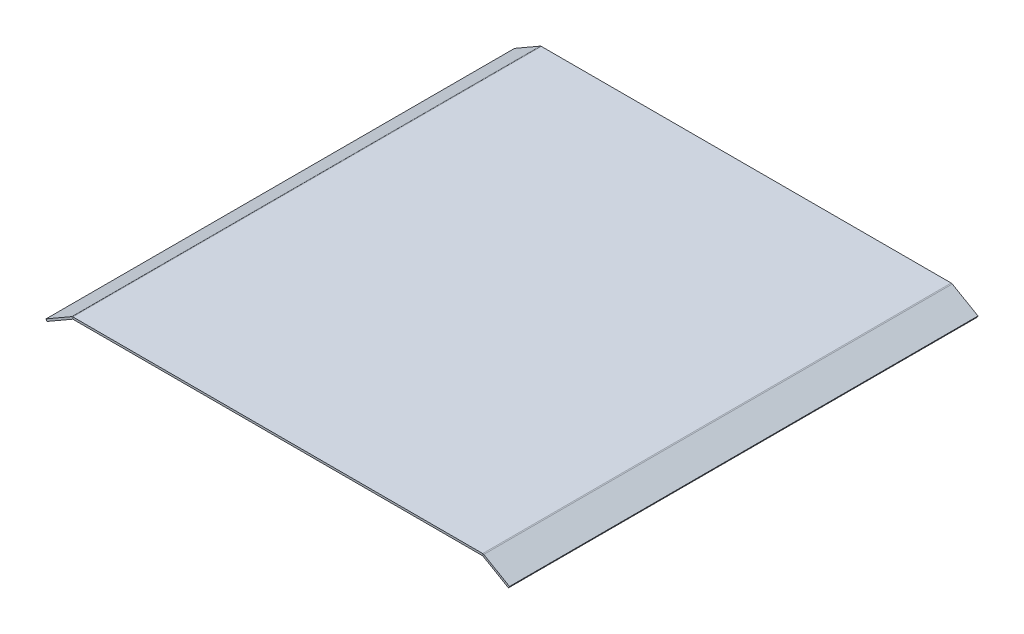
ISO-10303-21;
HEADER;
FILE_DESCRIPTION(('STEP AP214'),'2;1');
FILE_NAME('part.step','',(''),(''),'','','');
FILE_SCHEMA(('AUTOMOTIVE_DESIGN { 1 0 10303 214 1 1 1 1 }'));
ENDSEC;
DATA;
#1=APPLICATION_CONTEXT('core data for automotive mechanical design processes');
#2=APPLICATION_PROTOCOL_DEFINITION('international standard','automotive_design',2000,#1);
#3=PRODUCT_CONTEXT('',#1,'mechanical');
#4=PRODUCT('Part','Part','',(#3));
#5=PRODUCT_RELATED_PRODUCT_CATEGORY('part','',(#4));
#6=PRODUCT_DEFINITION_FORMATION('','',#4);
#7=PRODUCT_DEFINITION_CONTEXT('part definition',#1,'design');
#8=PRODUCT_DEFINITION('design','',#6,#7);
#9=PRODUCT_DEFINITION_SHAPE('','',#8);
#10=(LENGTH_UNIT() NAMED_UNIT(*) SI_UNIT(.MILLI.,.METRE.));
#11=(NAMED_UNIT(*) PLANE_ANGLE_UNIT() SI_UNIT($,.RADIAN.));
#12=(NAMED_UNIT(*) SI_UNIT($,.STERADIAN.) SOLID_ANGLE_UNIT());
#13=UNCERTAINTY_MEASURE_WITH_UNIT(LENGTH_MEASURE(1.E-05),#10,'distance_accuracy_value','');
#14=(GEOMETRIC_REPRESENTATION_CONTEXT(3) GLOBAL_UNCERTAINTY_ASSIGNED_CONTEXT((#13)) GLOBAL_UNIT_ASSIGNED_CONTEXT((#10,
#11,#12)) REPRESENTATION_CONTEXT('',''));
#15=CARTESIAN_POINT('',(0.,0.,0.));
#16=DIRECTION('',(0.,0.,1.));
#17=DIRECTION('',(1.,0.,0.));
#18=AXIS2_PLACEMENT_3D('',#15,#16,#17);
#19=CARTESIAN_POINT('',(-207.,2.,-232.));
#20=DIRECTION('',(0.,0.,1.));
#21=DIRECTION('',(1.,0.,0.));
#22=AXIS2_PLACEMENT_3D('',#19,#20,#21);
#23=PLANE('',#22);
#24=DIRECTION('',(0.,1.,0.));
#25=VECTOR('',#24,1.);
#26=CARTESIAN_POINT('',(202.986602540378,0.,-232.));
#27=LINE('',#26,#25);
#28=CARTESIAN_POINT('',(202.986602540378,0.,-232.));
#29=VERTEX_POINT('',#28);
#30=CARTESIAN_POINT('',(202.986602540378,2.,-232.));
#31=VERTEX_POINT('',#30);
#32=EDGE_CURVE('E223',#29,#31,#27,.T.);
#33=ORIENTED_EDGE('',*,*,#32,.F.);
#34=DIRECTION('',(-1.,0.,0.));
#35=VECTOR('',#34,1.);
#36=CARTESIAN_POINT('',(-207.,0.,-232.));
#37=LINE('',#36,#35);
#38=CARTESIAN_POINT('',(-202.986602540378,0.,-232.));
#39=VERTEX_POINT('',#38);
#40=EDGE_CURVE('E97',#29,#39,#37,.T.);
#41=ORIENTED_EDGE('',*,*,#40,.T.);
#42=DIRECTION('',(0.,1.,0.));
#43=VECTOR('',#42,1.);
#44=CARTESIAN_POINT('',(-202.986602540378,0.,-232.));
#45=LINE('',#44,#43);
#46=CARTESIAN_POINT('',(-202.986602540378,2.00000000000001,-232.));
#47=VERTEX_POINT('',#46);
#48=EDGE_CURVE('E267',#39,#47,#45,.T.);
#49=ORIENTED_EDGE('',*,*,#48,.T.);
#50=DIRECTION('',(-1.,0.,0.));
#51=VECTOR('',#50,1.);
#52=CARTESIAN_POINT('',(-207.,2.,-232.));
#53=LINE('',#52,#51);
#54=EDGE_CURVE('E82',#31,#47,#53,.T.);
#55=ORIENTED_EDGE('',*,*,#54,.F.);
#56=EDGE_LOOP('',(#33,#41,#49,#55));
#57=FACE_BOUND('',#56,.T.);
#58=ADVANCED_FACE('F74',(#57),#23,.F.);
#59=CARTESIAN_POINT('',(-207.,2.,232.));
#60=DIRECTION('',(0.,0.,-1.));
#61=DIRECTION('',(-1.,0.,0.));
#62=AXIS2_PLACEMENT_3D('',#59,#60,#61);
#63=PLANE('',#62);
#64=DIRECTION('',(0.,1.,0.));
#65=VECTOR('',#64,1.);
#66=CARTESIAN_POINT('',(202.986602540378,0.,232.));
#67=LINE('',#66,#65);
#68=CARTESIAN_POINT('',(202.986602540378,0.,232.));
#69=VERTEX_POINT('',#68);
#70=CARTESIAN_POINT('',(202.986602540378,1.99999999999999,232.));
#71=VERTEX_POINT('',#70);
#72=EDGE_CURVE('E214',#69,#71,#67,.T.);
#73=ORIENTED_EDGE('',*,*,#72,.T.);
#74=DIRECTION('',(1.,0.,0.));
#75=VECTOR('',#74,1.);
#76=CARTESIAN_POINT('',(-207.,2.,232.));
#77=LINE('',#76,#75);
#78=CARTESIAN_POINT('',(-202.986602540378,2.,232.));
#79=VERTEX_POINT('',#78);
#80=EDGE_CURVE('E13',#79,#71,#77,.T.);
#81=ORIENTED_EDGE('',*,*,#80,.F.);
#82=DIRECTION('',(0.,1.,0.));
#83=VECTOR('',#82,1.);
#84=CARTESIAN_POINT('',(-202.986602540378,0.,232.));
#85=LINE('',#84,#83);
#86=CARTESIAN_POINT('',(-202.986602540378,0.,232.));
#87=VERTEX_POINT('',#86);
#88=EDGE_CURVE('E278',#87,#79,#85,.T.);
#89=ORIENTED_EDGE('',*,*,#88,.F.);
#90=DIRECTION('',(1.,0.,0.));
#91=VECTOR('',#90,1.);
#92=CARTESIAN_POINT('',(-207.,0.,232.));
#93=LINE('',#92,#91);
#94=EDGE_CURVE('E77',#87,#69,#93,.T.);
#95=ORIENTED_EDGE('',*,*,#94,.T.);
#96=EDGE_LOOP('',(#73,#81,#89,#95));
#97=FACE_BOUND('',#96,.T.);
#98=ADVANCED_FACE('F285',(#97),#63,.F.);
#99=CARTESIAN_POINT('',(207.,2.,-232.));
#100=DIRECTION('',(0.,-1.,0.));
#101=DIRECTION('',(0.,0.,-1.));
#102=AXIS2_PLACEMENT_3D('',#99,#100,#101);
#103=PLANE('',#102);
#104=DIRECTION('',(0.,0.,1.));
#105=VECTOR('',#104,1.);
#106=CARTESIAN_POINT('',(202.986602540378,1.99999999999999,232.));
#107=LINE('',#106,#105);
#108=EDGE_CURVE('E208',#71,#31,#107,.F.);
#109=ORIENTED_EDGE('',*,*,#108,.T.);
#110=ORIENTED_EDGE('',*,*,#54,.T.);
#111=DIRECTION('',(0.,0.,-1.));
#112=VECTOR('',#111,1.);
#113=CARTESIAN_POINT('',(-202.986602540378,2.00000000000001,-232.));
#114=LINE('',#113,#112);
#115=EDGE_CURVE('E261',#47,#79,#114,.F.);
#116=ORIENTED_EDGE('',*,*,#115,.T.);
#117=ORIENTED_EDGE('',*,*,#80,.T.);
#118=EDGE_LOOP('',(#109,#110,#116,#117));
#119=FACE_BOUND('',#118,.T.);
#120=ADVANCED_FACE('F307',(#119),#103,.F.);
#121=CARTESIAN_POINT('',(207.,0.,-232.));
#122=DIRECTION('',(0.,-1.,0.));
#123=DIRECTION('',(0.,0.,-1.));
#124=AXIS2_PLACEMENT_3D('',#121,#122,#123);
#125=PLANE('',#124);
#126=ORIENTED_EDGE('',*,*,#40,.F.);
#127=DIRECTION('',(0.,0.,1.));
#128=VECTOR('',#127,1.);
#129=CARTESIAN_POINT('',(202.986602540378,0.,232.));
#130=LINE('',#129,#128);
#131=EDGE_CURVE('E90',#69,#29,#130,.F.);
#132=ORIENTED_EDGE('',*,*,#131,.F.);
#133=ORIENTED_EDGE('',*,*,#94,.F.);
#134=DIRECTION('',(0.,0.,-1.));
#135=VECTOR('',#134,1.);
#136=CARTESIAN_POINT('',(-202.986602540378,0.,-232.));
#137=LINE('',#136,#135);
#138=EDGE_CURVE('E273',#39,#87,#137,.F.);
#139=ORIENTED_EDGE('',*,*,#138,.F.);
#140=EDGE_LOOP('',(#126,#132,#133,#139));
#141=FACE_BOUND('',#140,.T.);
#142=ADVANCED_FACE('F341',(#141),#125,.T.);
#143=CARTESIAN_POINT('',(-202.986602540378,-0.0499999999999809,232.));
#144=DIRECTION('',(0.,0.,1.));
#145=DIRECTION('',(1.,0.,0.));
#146=AXIS2_PLACEMENT_3D('',#143,#144,#145);
#147=PLANE('',#146);
#148=DIRECTION('',(-0.499999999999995,0.866025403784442,0.));
#149=VECTOR('',#148,1.);
#150=CARTESIAN_POINT('',(-204.011602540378,1.72535207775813,232.));
#151=LINE('',#150,#149);
#152=CARTESIAN_POINT('',(-203.011602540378,-0.00669872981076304,232.));
#153=VERTEX_POINT('',#152);
#154=CARTESIAN_POINT('',(-204.011602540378,1.72535207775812,232.));
#155=VERTEX_POINT('',#154);
#156=EDGE_CURVE('E226',#153,#155,#151,.T.);
#157=ORIENTED_EDGE('',*,*,#156,.F.);
#158=CARTESIAN_POINT('',(-202.986602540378,-0.0499999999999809,232.));
#159=DIRECTION('',(0.,0.,-1.));
#160=DIRECTION('',(-1.,0.,0.));
#161=AXIS2_PLACEMENT_3D('',#158,#159,#160);
#162=CIRCLE('',#161,0.0499999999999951);
#163=EDGE_CURVE('E270',#87,#153,#162,.F.);
#164=ORIENTED_EDGE('',*,*,#163,.F.);
#165=ORIENTED_EDGE('',*,*,#88,.T.);
#166=CARTESIAN_POINT('',(-202.986602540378,-0.0499999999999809,232.));
#167=DIRECTION('',(0.,0.,-1.));
#168=DIRECTION('',(-1.,0.,0.));
#169=AXIS2_PLACEMENT_3D('',#166,#167,#168);
#170=CIRCLE('',#169,2.05);
#171=EDGE_CURVE('E263',#79,#155,#170,.F.);
#172=ORIENTED_EDGE('',*,*,#171,.T.);
#173=EDGE_LOOP('',(#157,#164,#165,#172));
#174=FACE_BOUND('',#173,.T.);
#175=ADVANCED_FACE('F339',(#174),#147,.T.);
#176=CARTESIAN_POINT('',(-202.986602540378,-0.0499999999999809,-232.));
#177=DIRECTION('',(0.,0.,1.));
#178=DIRECTION('',(1.,0.,0.));
#179=AXIS2_PLACEMENT_3D('',#176,#177,#178);
#180=PLANE('',#179);
#181=CARTESIAN_POINT('',(-202.986602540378,-0.0499999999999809,-232.));
#182=DIRECTION('',(0.,0.,-1.));
#183=DIRECTION('',(-1.,0.,0.));
#184=AXIS2_PLACEMENT_3D('',#181,#182,#183);
#185=CIRCLE('',#184,0.0499999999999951);
#186=CARTESIAN_POINT('',(-203.011602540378,-0.00669872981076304,-232.));
#187=VERTEX_POINT('',#186);
#188=EDGE_CURVE('E231',#187,#39,#185,.T.);
#189=ORIENTED_EDGE('',*,*,#188,.F.);
#190=DIRECTION('',(-0.499999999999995,0.866025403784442,0.));
#191=VECTOR('',#190,1.);
#192=CARTESIAN_POINT('',(-203.011602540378,-0.00669872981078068,-232.));
#193=LINE('',#192,#191);
#194=CARTESIAN_POINT('',(-204.011602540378,1.72535207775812,-232.));
#195=VERTEX_POINT('',#194);
#196=EDGE_CURVE('E254',#187,#195,#193,.T.);
#197=ORIENTED_EDGE('',*,*,#196,.T.);
#198=CARTESIAN_POINT('',(-202.986602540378,-0.0499999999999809,-232.));
#199=DIRECTION('',(0.,0.,-1.));
#200=DIRECTION('',(-1.,0.,0.));
#201=AXIS2_PLACEMENT_3D('',#198,#199,#200);
#202=CIRCLE('',#201,2.05);
#203=EDGE_CURVE('E264',#195,#47,#202,.T.);
#204=ORIENTED_EDGE('',*,*,#203,.T.);
#205=ORIENTED_EDGE('',*,*,#48,.F.);
#206=EDGE_LOOP('',(#189,#197,#204,#205));
#207=FACE_BOUND('',#206,.T.);
#208=ADVANCED_FACE('F312',(#207),#180,.F.);
#209=CARTESIAN_POINT('',(-202.986602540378,-0.0499999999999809,-232.));
#210=DIRECTION('',(0.,0.,-1.));
#211=DIRECTION('',(-0.499999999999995,0.866025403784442,0.));
#212=AXIS2_PLACEMENT_3D('',#209,#210,#211);
#213=CYLINDRICAL_SURFACE('',#212,2.05);
#214=ORIENTED_EDGE('',*,*,#115,.F.);
#215=ORIENTED_EDGE('',*,*,#203,.F.);
#216=DIRECTION('',(0.,0.,-1.));
#217=VECTOR('',#216,1.);
#218=CARTESIAN_POINT('',(-204.011602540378,1.72535207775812,-232.));
#219=LINE('',#218,#217);
#220=EDGE_CURVE('E251',#155,#195,#219,.T.);
#221=ORIENTED_EDGE('',*,*,#220,.F.);
#222=ORIENTED_EDGE('',*,*,#171,.F.);
#223=EDGE_LOOP('',(#214,#215,#221,#222));
#224=FACE_BOUND('',#223,.T.);
#225=ADVANCED_FACE('F337',(#224),#213,.T.);
#226=CARTESIAN_POINT('',(-202.986602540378,-0.0499999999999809,-232.));
#227=DIRECTION('',(0.,0.,-1.));
#228=DIRECTION('',(-0.499999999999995,0.866025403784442,0.));
#229=AXIS2_PLACEMENT_3D('',#226,#227,#228);
#230=CYLINDRICAL_SURFACE('',#229,0.0499999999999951);
#231=ORIENTED_EDGE('',*,*,#138,.T.);
#232=ORIENTED_EDGE('',*,*,#163,.T.);
#233=DIRECTION('',(0.,0.,1.));
#234=VECTOR('',#233,1.);
#235=CARTESIAN_POINT('',(-203.011602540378,-0.00669872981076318,232.));
#236=LINE('',#235,#234);
#237=EDGE_CURVE('E257',#153,#187,#236,.F.);
#238=ORIENTED_EDGE('',*,*,#237,.T.);
#239=ORIENTED_EDGE('',*,*,#188,.T.);
#240=EDGE_LOOP('',(#231,#232,#238,#239));
#241=FACE_BOUND('',#240,.T.);
#242=ADVANCED_FACE('F314',(#241),#230,.F.);
#243=CARTESIAN_POINT('',(-204.,1.73205080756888,-232.));
#244=DIRECTION('',(0.,0.,-1.));
#245=DIRECTION('',(-1.,0.,0.));
#246=AXIS2_PLACEMENT_3D('',#243,#244,#245);
#247=PLANE('',#246);
#248=DIRECTION('',(0.866025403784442,0.499999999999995,0.));
#249=VECTOR('',#248,1.);
#250=CARTESIAN_POINT('',(-204.,1.73205080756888,-232.));
#251=LINE('',#250,#249);
#252=CARTESIAN_POINT('',(-229.516660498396,-12.9999999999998,-232.));
#253=VERTEX_POINT('',#252);
#254=EDGE_CURVE('E235',#253,#195,#251,.T.);
#255=ORIENTED_EDGE('',*,*,#254,.T.);
#256=ORIENTED_EDGE('',*,*,#196,.F.);
#257=DIRECTION('',(-0.866025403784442,-0.499999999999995,0.));
#258=VECTOR('',#257,1.);
#259=CARTESIAN_POINT('',(-203.,0.,-232.));
#260=LINE('',#259,#258);
#261=CARTESIAN_POINT('',(-228.516660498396,-14.7320508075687,-232.));
#262=VERTEX_POINT('',#261);
#263=EDGE_CURVE('E243',#262,#187,#260,.F.);
#264=ORIENTED_EDGE('',*,*,#263,.F.);
#265=DIRECTION('',(0.499999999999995,-0.866025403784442,0.));
#266=VECTOR('',#265,1.);
#267=CARTESIAN_POINT('',(-229.516660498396,-12.9999999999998,-232.));
#268=LINE('',#267,#266);
#269=EDGE_CURVE('E229',#253,#262,#268,.T.);
#270=ORIENTED_EDGE('',*,*,#269,.F.);
#271=EDGE_LOOP('',(#255,#256,#264,#270));
#272=FACE_BOUND('',#271,.T.);
#273=ADVANCED_FACE('F331',(#272),#247,.T.);
#274=CARTESIAN_POINT('',(-229.516660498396,-12.9999999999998,232.));
#275=DIRECTION('',(0.,0.,1.));
#276=DIRECTION('',(1.,0.,0.));
#277=AXIS2_PLACEMENT_3D('',#274,#275,#276);
#278=PLANE('',#277);
#279=DIRECTION('',(0.866025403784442,0.499999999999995,0.));
#280=VECTOR('',#279,1.);
#281=CARTESIAN_POINT('',(-203.,0.,232.));
#282=LINE('',#281,#280);
#283=CARTESIAN_POINT('',(-228.516660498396,-14.7320508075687,232.));
#284=VERTEX_POINT('',#283);
#285=EDGE_CURVE('E249',#153,#284,#282,.F.);
#286=ORIENTED_EDGE('',*,*,#285,.F.);
#287=ORIENTED_EDGE('',*,*,#156,.T.);
#288=DIRECTION('',(-0.866025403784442,-0.499999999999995,0.));
#289=VECTOR('',#288,1.);
#290=CARTESIAN_POINT('',(-229.516660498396,-12.9999999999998,232.));
#291=LINE('',#290,#289);
#292=CARTESIAN_POINT('',(-229.516660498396,-12.9999999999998,232.));
#293=VERTEX_POINT('',#292);
#294=EDGE_CURVE('E241',#155,#293,#291,.T.);
#295=ORIENTED_EDGE('',*,*,#294,.T.);
#296=DIRECTION('',(0.499999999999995,-0.866025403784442,0.));
#297=VECTOR('',#296,1.);
#298=CARTESIAN_POINT('',(-229.516660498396,-12.9999999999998,232.));
#299=LINE('',#298,#297);
#300=EDGE_CURVE('E232',#293,#284,#299,.T.);
#301=ORIENTED_EDGE('',*,*,#300,.T.);
#302=EDGE_LOOP('',(#286,#287,#295,#301));
#303=FACE_BOUND('',#302,.T.);
#304=ADVANCED_FACE('F323',(#303),#278,.T.);
#305=CARTESIAN_POINT('',(-204.,1.73205080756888,-232.));
#306=DIRECTION('',(-0.499999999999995,0.866025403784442,0.));
#307=DIRECTION('',(-0.866025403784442,-0.499999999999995,0.));
#308=AXIS2_PLACEMENT_3D('',#305,#306,#307);
#309=PLANE('',#308);
#310=ORIENTED_EDGE('',*,*,#294,.F.);
#311=ORIENTED_EDGE('',*,*,#220,.T.);
#312=ORIENTED_EDGE('',*,*,#254,.F.);
#313=DIRECTION('',(0.,0.,-1.));
#314=VECTOR('',#313,1.);
#315=CARTESIAN_POINT('',(-229.516660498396,-12.9999999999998,-232.));
#316=LINE('',#315,#314);
#317=EDGE_CURVE('E238',#293,#253,#316,.T.);
#318=ORIENTED_EDGE('',*,*,#317,.F.);
#319=EDGE_LOOP('',(#310,#311,#312,#318));
#320=FACE_BOUND('',#319,.T.);
#321=ADVANCED_FACE('F334',(#320),#309,.T.);
#322=CARTESIAN_POINT('',(-203.,0.,-232.));
#323=DIRECTION('',(-0.499999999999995,0.866025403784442,0.));
#324=DIRECTION('',(-0.866025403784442,-0.499999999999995,0.));
#325=AXIS2_PLACEMENT_3D('',#322,#323,#324);
#326=PLANE('',#325);
#327=ORIENTED_EDGE('',*,*,#237,.F.);
#328=ORIENTED_EDGE('',*,*,#285,.T.);
#329=DIRECTION('',(0.,0.,1.));
#330=VECTOR('',#329,1.);
#331=CARTESIAN_POINT('',(-228.516660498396,-14.7320508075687,-232.));
#332=LINE('',#331,#330);
#333=EDGE_CURVE('E246',#284,#262,#332,.F.);
#334=ORIENTED_EDGE('',*,*,#333,.T.);
#335=ORIENTED_EDGE('',*,*,#263,.T.);
#336=EDGE_LOOP('',(#327,#328,#334,#335));
#337=FACE_BOUND('',#336,.T.);
#338=ADVANCED_FACE('F319',(#337),#326,.F.);
#339=CARTESIAN_POINT('',(-229.516660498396,-12.9999999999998,-232.));
#340=DIRECTION('',(-0.866025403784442,-0.499999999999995,0.));
#341=DIRECTION('',(0.499999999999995,-0.866025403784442,0.));
#342=AXIS2_PLACEMENT_3D('',#339,#340,#341);
#343=PLANE('',#342);
#344=ORIENTED_EDGE('',*,*,#333,.F.);
#345=ORIENTED_EDGE('',*,*,#300,.F.);
#346=ORIENTED_EDGE('',*,*,#317,.T.);
#347=ORIENTED_EDGE('',*,*,#269,.T.);
#348=EDGE_LOOP('',(#344,#345,#346,#347));
#349=FACE_BOUND('',#348,.T.);
#350=ADVANCED_FACE('F329',(#349),#343,.T.);
#351=CARTESIAN_POINT('',(202.986602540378,-0.0500000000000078,-232.));
#352=DIRECTION('',(0.,0.,-1.));
#353=DIRECTION('',(-1.,0.,0.));
#354=AXIS2_PLACEMENT_3D('',#351,#352,#353);
#355=PLANE('',#354);
#356=DIRECTION('',(0.499999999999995,0.866025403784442,0.));
#357=VECTOR('',#356,1.);
#358=CARTESIAN_POINT('',(204.011602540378,1.7253520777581,-232.));
#359=LINE('',#358,#357);
#360=CARTESIAN_POINT('',(203.011602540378,-0.00669872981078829,-232.));
#361=VERTEX_POINT('',#360);
#362=CARTESIAN_POINT('',(204.011602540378,1.72535207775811,-232.));
#363=VERTEX_POINT('',#362);
#364=EDGE_CURVE('E205',#361,#363,#359,.T.);
#365=ORIENTED_EDGE('',*,*,#364,.F.);
#366=CARTESIAN_POINT('',(202.986602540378,-0.0500000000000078,-232.));
#367=DIRECTION('',(0.,0.,1.));
#368=DIRECTION('',(1.,0.,0.));
#369=AXIS2_PLACEMENT_3D('',#366,#367,#368);
#370=CIRCLE('',#369,0.049999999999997);
#371=EDGE_CURVE('E217',#29,#361,#370,.F.);
#372=ORIENTED_EDGE('',*,*,#371,.F.);
#373=ORIENTED_EDGE('',*,*,#32,.T.);
#374=CARTESIAN_POINT('',(202.986602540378,-0.0500000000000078,-232.));
#375=DIRECTION('',(0.,0.,1.));
#376=DIRECTION('',(1.,0.,0.));
#377=AXIS2_PLACEMENT_3D('',#374,#375,#376);
#378=CIRCLE('',#377,2.05);
#379=EDGE_CURVE('E210',#31,#363,#378,.F.);
#380=ORIENTED_EDGE('',*,*,#379,.T.);
#381=EDGE_LOOP('',(#365,#372,#373,#380));
#382=FACE_BOUND('',#381,.T.);
#383=ADVANCED_FACE('F301',(#382),#355,.T.);
#384=CARTESIAN_POINT('',(202.986602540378,-0.0500000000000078,232.));
#385=DIRECTION('',(0.,0.,-1.));
#386=DIRECTION('',(-1.,0.,0.));
#387=AXIS2_PLACEMENT_3D('',#384,#385,#386);
#388=PLANE('',#387);
#389=CARTESIAN_POINT('',(202.986602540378,-0.0500000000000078,232.));
#390=DIRECTION('',(0.,0.,1.));
#391=DIRECTION('',(1.,0.,0.));
#392=AXIS2_PLACEMENT_3D('',#389,#390,#391);
#393=CIRCLE('',#392,0.049999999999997);
#394=CARTESIAN_POINT('',(203.011602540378,-0.00669872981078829,232.));
#395=VERTEX_POINT('',#394);
#396=EDGE_CURVE('E175',#395,#69,#393,.T.);
#397=ORIENTED_EDGE('',*,*,#396,.F.);
#398=DIRECTION('',(0.499999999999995,0.866025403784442,0.));
#399=VECTOR('',#398,1.);
#400=CARTESIAN_POINT('',(203.011602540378,-0.00669872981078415,232.));
#401=LINE('',#400,#399);
#402=CARTESIAN_POINT('',(204.011602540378,1.7253520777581,232.));
#403=VERTEX_POINT('',#402);
#404=EDGE_CURVE('E200',#395,#403,#401,.T.);
#405=ORIENTED_EDGE('',*,*,#404,.T.);
#406=CARTESIAN_POINT('',(202.986602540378,-0.0500000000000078,232.));
#407=DIRECTION('',(0.,0.,1.));
#408=DIRECTION('',(1.,0.,0.));
#409=AXIS2_PLACEMENT_3D('',#406,#407,#408);
#410=CIRCLE('',#409,2.05);
#411=EDGE_CURVE('E211',#403,#71,#410,.T.);
#412=ORIENTED_EDGE('',*,*,#411,.T.);
#413=ORIENTED_EDGE('',*,*,#72,.F.);
#414=EDGE_LOOP('',(#397,#405,#412,#413));
#415=FACE_BOUND('',#414,.T.);
#416=ADVANCED_FACE('F290',(#415),#388,.F.);
#417=CARTESIAN_POINT('',(202.986602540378,-0.0500000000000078,232.));
#418=DIRECTION('',(0.,0.,1.));
#419=DIRECTION('',(0.499999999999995,0.866025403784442,0.));
#420=AXIS2_PLACEMENT_3D('',#417,#418,#419);
#421=CYLINDRICAL_SURFACE('',#420,2.05);
#422=ORIENTED_EDGE('',*,*,#108,.F.);
#423=ORIENTED_EDGE('',*,*,#411,.F.);
#424=DIRECTION('',(0.,0.,1.));
#425=VECTOR('',#424,1.);
#426=CARTESIAN_POINT('',(204.011602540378,1.7253520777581,-232.));
#427=LINE('',#426,#425);
#428=EDGE_CURVE('E184',#403,#363,#427,.F.);
#429=ORIENTED_EDGE('',*,*,#428,.T.);
#430=ORIENTED_EDGE('',*,*,#379,.F.);
#431=EDGE_LOOP('',(#422,#423,#429,#430));
#432=FACE_BOUND('',#431,.T.);
#433=ADVANCED_FACE('F304',(#432),#421,.T.);
#434=CARTESIAN_POINT('',(202.986602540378,-0.0500000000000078,232.));
#435=DIRECTION('',(0.,0.,1.));
#436=DIRECTION('',(0.499999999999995,0.866025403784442,0.));
#437=AXIS2_PLACEMENT_3D('',#434,#435,#436);
#438=CYLINDRICAL_SURFACE('',#437,0.049999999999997);
#439=ORIENTED_EDGE('',*,*,#131,.T.);
#440=ORIENTED_EDGE('',*,*,#371,.T.);
#441=DIRECTION('',(0.,0.,1.));
#442=VECTOR('',#441,1.);
#443=CARTESIAN_POINT('',(203.011602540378,-0.00669872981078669,-232.));
#444=LINE('',#443,#442);
#445=EDGE_CURVE('E203',#361,#395,#444,.T.);
#446=ORIENTED_EDGE('',*,*,#445,.T.);
#447=ORIENTED_EDGE('',*,*,#396,.T.);
#448=EDGE_LOOP('',(#439,#440,#446,#447));
#449=FACE_BOUND('',#448,.T.);
#450=ADVANCED_FACE('F292',(#449),#438,.F.);
#451=CARTESIAN_POINT('',(204.,1.73205080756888,-232.));
#452=DIRECTION('',(0.,0.,-1.));
#453=DIRECTION('',(-1.,0.,0.));
#454=AXIS2_PLACEMENT_3D('',#451,#452,#453);
#455=PLANE('',#454);
#456=DIRECTION('',(0.866025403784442,-0.499999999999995,0.));
#457=VECTOR('',#456,1.);
#458=CARTESIAN_POINT('',(228.516660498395,-14.7320508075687,-232.));
#459=LINE('',#458,#457);
#460=CARTESIAN_POINT('',(228.516660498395,-14.7320508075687,-232.));
#461=VERTEX_POINT('',#460);
#462=EDGE_CURVE('E197',#361,#461,#459,.T.);
#463=ORIENTED_EDGE('',*,*,#462,.F.);
#464=ORIENTED_EDGE('',*,*,#364,.T.);
#465=DIRECTION('',(-0.866025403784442,0.499999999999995,0.));
#466=VECTOR('',#465,1.);
#467=CARTESIAN_POINT('',(204.,1.73205080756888,-232.));
#468=LINE('',#467,#466);
#469=CARTESIAN_POINT('',(229.516660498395,-12.9999999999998,-232.));
#470=VERTEX_POINT('',#469);
#471=EDGE_CURVE('E189',#363,#470,#468,.F.);
#472=ORIENTED_EDGE('',*,*,#471,.T.);
#473=DIRECTION('',(-0.499999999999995,-0.866025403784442,0.));
#474=VECTOR('',#473,1.);
#475=CARTESIAN_POINT('',(229.516660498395,-12.9999999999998,-232.));
#476=LINE('',#475,#474);
#477=EDGE_CURVE('E176',#470,#461,#476,.T.);
#478=ORIENTED_EDGE('',*,*,#477,.T.);
#479=EDGE_LOOP('',(#463,#464,#472,#478));
#480=FACE_BOUND('',#479,.T.);
#481=ADVANCED_FACE('F299',(#480),#455,.T.);
#482=CARTESIAN_POINT('',(229.516660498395,-12.9999999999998,232.));
#483=DIRECTION('',(0.,0.,1.));
#484=DIRECTION('',(1.,0.,0.));
#485=AXIS2_PLACEMENT_3D('',#482,#483,#484);
#486=PLANE('',#485);
#487=DIRECTION('',(0.866025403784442,-0.499999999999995,0.));
#488=VECTOR('',#487,1.);
#489=CARTESIAN_POINT('',(229.516660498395,-12.9999999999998,232.));
#490=LINE('',#489,#488);
#491=CARTESIAN_POINT('',(229.516660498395,-12.9999999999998,232.));
#492=VERTEX_POINT('',#491);
#493=EDGE_CURVE('E168',#492,#403,#490,.F.);
#494=ORIENTED_EDGE('',*,*,#493,.T.);
#495=ORIENTED_EDGE('',*,*,#404,.F.);
#496=DIRECTION('',(-0.866025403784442,0.499999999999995,0.));
#497=VECTOR('',#496,1.);
#498=CARTESIAN_POINT('',(228.516660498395,-14.7320508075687,232.));
#499=LINE('',#498,#497);
#500=CARTESIAN_POINT('',(228.516660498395,-14.7320508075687,232.));
#501=VERTEX_POINT('',#500);
#502=EDGE_CURVE('E170',#501,#395,#499,.T.);
#503=ORIENTED_EDGE('',*,*,#502,.F.);
#504=DIRECTION('',(-0.499999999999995,-0.866025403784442,0.));
#505=VECTOR('',#504,1.);
#506=CARTESIAN_POINT('',(229.516660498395,-12.9999999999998,232.));
#507=LINE('',#506,#505);
#508=EDGE_CURVE('E164',#492,#501,#507,.T.);
#509=ORIENTED_EDGE('',*,*,#508,.F.);
#510=EDGE_LOOP('',(#494,#495,#503,#509));
#511=FACE_BOUND('',#510,.T.);
#512=ADVANCED_FACE('F166',(#511),#486,.T.);
#513=CARTESIAN_POINT('',(229.516660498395,-12.9999999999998,-232.));
#514=DIRECTION('',(-0.499999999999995,-0.866025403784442,0.));
#515=DIRECTION('',(0.866025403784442,-0.499999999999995,0.));
#516=AXIS2_PLACEMENT_3D('',#513,#514,#515);
#517=PLANE('',#516);
#518=ORIENTED_EDGE('',*,*,#428,.F.);
#519=ORIENTED_EDGE('',*,*,#493,.F.);
#520=DIRECTION('',(0.,0.,-1.));
#521=VECTOR('',#520,1.);
#522=CARTESIAN_POINT('',(229.516660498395,-12.9999999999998,-232.));
#523=LINE('',#522,#521);
#524=EDGE_CURVE('E183',#470,#492,#523,.F.);
#525=ORIENTED_EDGE('',*,*,#524,.F.);
#526=ORIENTED_EDGE('',*,*,#471,.F.);
#527=EDGE_LOOP('',(#518,#519,#525,#526));
#528=FACE_BOUND('',#527,.T.);
#529=ADVANCED_FACE('F181',(#528),#517,.F.);
#530=CARTESIAN_POINT('',(228.516660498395,-14.7320508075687,-232.));
#531=DIRECTION('',(-0.499999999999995,-0.866025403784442,0.));
#532=DIRECTION('',(0.866025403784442,-0.499999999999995,0.));
#533=AXIS2_PLACEMENT_3D('',#530,#531,#532);
#534=PLANE('',#533);
#535=ORIENTED_EDGE('',*,*,#502,.T.);
#536=ORIENTED_EDGE('',*,*,#445,.F.);
#537=ORIENTED_EDGE('',*,*,#462,.T.);
#538=DIRECTION('',(0.,0.,1.));
#539=VECTOR('',#538,1.);
#540=CARTESIAN_POINT('',(228.516660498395,-14.7320508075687,-232.));
#541=LINE('',#540,#539);
#542=EDGE_CURVE('E195',#461,#501,#541,.T.);
#543=ORIENTED_EDGE('',*,*,#542,.T.);
#544=EDGE_LOOP('',(#535,#536,#537,#543));
#545=FACE_BOUND('',#544,.T.);
#546=ADVANCED_FACE('F297',(#545),#534,.T.);
#547=CARTESIAN_POINT('',(229.516660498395,-12.9999999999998,-232.));
#548=DIRECTION('',(0.866025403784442,-0.499999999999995,0.));
#549=DIRECTION('',(0.499999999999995,0.866025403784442,0.));
#550=AXIS2_PLACEMENT_3D('',#547,#548,#549);
#551=PLANE('',#550);
#552=ORIENTED_EDGE('',*,*,#542,.F.);
#553=ORIENTED_EDGE('',*,*,#477,.F.);
#554=ORIENTED_EDGE('',*,*,#524,.T.);
#555=ORIENTED_EDGE('',*,*,#508,.T.);
#556=EDGE_LOOP('',(#552,#553,#554,#555));
#557=FACE_BOUND('',#556,.T.);
#558=ADVANCED_FACE('F187',(#557),#551,.T.);
#559=CLOSED_SHELL('',(#58,#98,#120,#142,#175,#208,#225,#242,#273,#304,#321,#338,#350,#383,#416,
#433,#450,#481,#512,#529,#546,#558));
#560=MANIFOLD_SOLID_BREP('B2',#559);
#561=ADVANCED_BREP_SHAPE_REPRESENTATION('',(#18,#560),#14);
#562=SHAPE_DEFINITION_REPRESENTATION(#9,#561);
ENDSEC;
END-ISO-10303-21;
